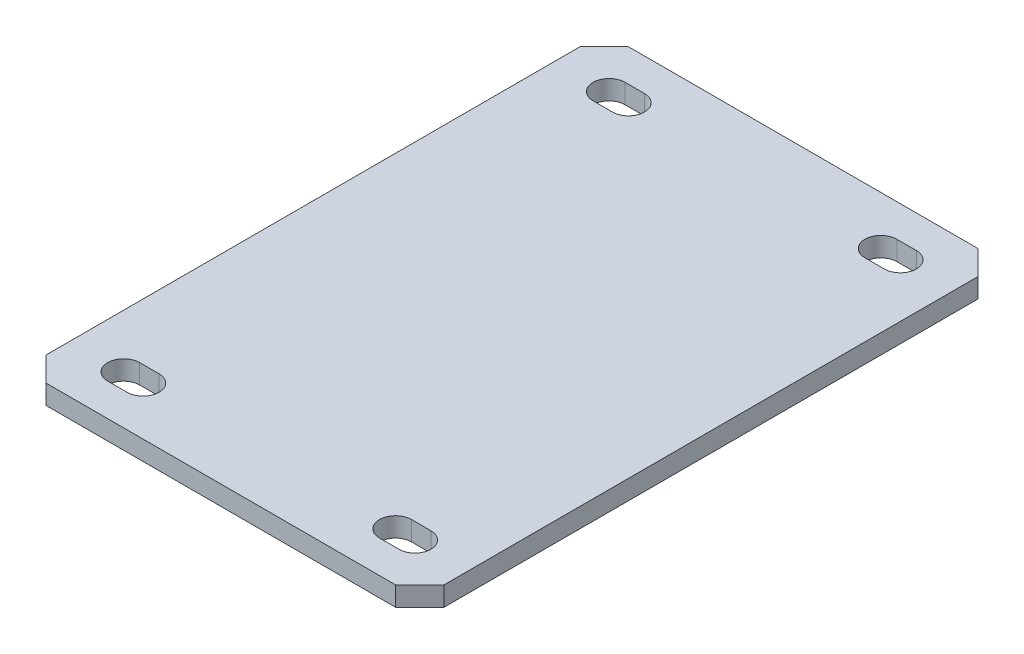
from build123d import *

# Parameters (mm, degrees)
SKIZZE1_W                       = 150
SKIZZE1_H                       = 120
AUFSATZ_LINEAR_AUSTRAGEN1_DEPTH = 4
M6_GEWINDEBOHRUNG1_D            = 5
SCHNITT_LINEAR_AUSTRAGEN1_DEPTH = 97.13012015
SKIZZE5_W                       = 7
SKIZZE5_H                       = 120
SCHNITT_LINEAR_AUSTRAGEN2_DEPTH = 97.13012015
SKIZZE6_W                       = 61
SKIZZE6_H                       = 120
SCHNITT_LINEAR_AUSTRAGEN3_DEPTH = 97.13012015
FASE1_SIZE                      = 5


with BuildPart() as part:
    # Skizze1 → Aufsatz-Linear austragen1 (new body)
    with BuildSketch(Plane(origin=(0, 0, 0), x_dir=(1, 0, 0), z_dir=(0, 1, 0))):
        Rectangle(SKIZZE1_W, SKIZZE1_H)
    extrude(amount=AUFSATZ_LINEAR_AUSTRAGEN1_DEPTH)

    # M6 Gewindebohrung1 (through all)
    with Locations(Plane(origin=(0, 4, 0), x_dir=(1, 0, 0), z_dir=(0, 1, 0))):
        with Locations((-55, 50), (55, -50), (-55, -50), (55, 50), (1, 50), (1, -50)):
            Hole(M6_GEWINDEBOHRUNG1_D / 2)

    # Skizze4 → Schnitt-Linear austragen1 (cut, through all)
    with BuildSketch(Plane(origin=(0, 4, 0), x_dir=(1, 0, 0), z_dir=(0, 1, 0))):
        with BuildLine():
            Line((-57, 53.3), (-53, 53.3))
            ThreePointArc((-53, 53.3), (-49.7, 50), (-53, 46.7))
            Line((-53, 46.7), (-57, 46.7))
            ThreePointArc((-57, 46.7), (-60.3, 50), (-57, 53.3))
        make_face()
        with BuildLine():
            Line((-57, -46.7), (-53, -46.7))
            ThreePointArc((-53, -46.7), (-49.7, -50), (-53, -53.3))
            Line((-53, -53.3), (-57, -53.3))
            ThreePointArc((-57, -53.3), (-60.3, -50), (-57, -46.7))
        make_face()
        with BuildLine():
            Line((-1, -46.7), (3, -46.7))
            ThreePointArc((3, -46.7), (6.3, -50), (3, -53.3))
            Line((3, -53.3), (-1, -53.3))
            ThreePointArc((-1, -53.3), (-4.3, -50), (-1, -46.7))
        make_face()
        with BuildLine():
            Line((-1, 53.3), (3, 53.3))
            ThreePointArc((3, 53.3), (6.3, 50), (3, 46.7))
            Line((3, 46.7), (-1, 46.7))
            ThreePointArc((-1, 46.7), (-4.3, 50), (-1, 53.3))
        make_face()
    extrude(amount=-SCHNITT_LINEAR_AUSTRAGEN1_DEPTH, mode=Mode.SUBTRACT)

    # Skizze5 → Schnitt-Linear austragen2 (cut, through all)
    with BuildSketch(Plane(origin=(0, 4, 0), x_dir=(1, 0, 0), z_dir=(0, 1, 0))):
        with Locations((-71.5, 0)):
            Rectangle(SKIZZE5_W, SKIZZE5_H)
    extrude(amount=-SCHNITT_LINEAR_AUSTRAGEN2_DEPTH, mode=Mode.SUBTRACT)

    # Skizze6 → Schnitt-Linear austragen3 (cut, through all)
    with BuildSketch(Plane.XZ):
        with Locations((44.5, 0)):
            Rectangle(SKIZZE6_W, SKIZZE6_H)
    extrude(amount=-SCHNITT_LINEAR_AUSTRAGEN3_DEPTH, mode=Mode.SUBTRACT)

    # Fase1
    fase1_edges = [part.edges().sort_by_distance(p)[0] for p in [
        (-68, 2, -60),
        (-68, 2, 60),
        (14, 2, -60),
        (14, 2, 60),
    ]]
    chamfer(fase1_edges, length=FASE1_SIZE)


solid = part.part
